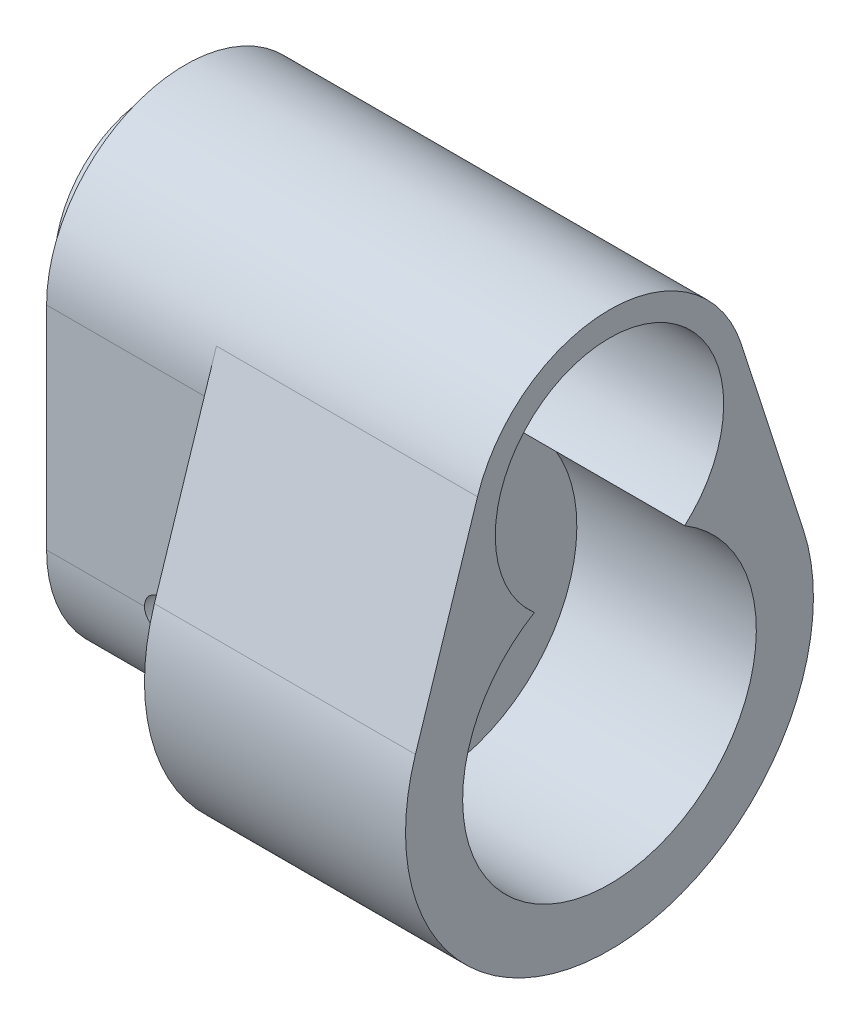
ISO-10303-21;
HEADER;
FILE_DESCRIPTION(('STEP AP214'),'2;1');
FILE_NAME('part.step','',(''),(''),'','','');
FILE_SCHEMA(('AUTOMOTIVE_DESIGN { 1 0 10303 214 1 1 1 1 }'));
ENDSEC;
DATA;
#1=APPLICATION_CONTEXT('core data for automotive mechanical design processes');
#2=APPLICATION_PROTOCOL_DEFINITION('international standard','automotive_design',2000,#1);
#3=PRODUCT_CONTEXT('',#1,'mechanical');
#4=PRODUCT('Part','Part','',(#3));
#5=PRODUCT_RELATED_PRODUCT_CATEGORY('part','',(#4));
#6=PRODUCT_DEFINITION_FORMATION('','',#4);
#7=PRODUCT_DEFINITION_CONTEXT('part definition',#1,'design');
#8=PRODUCT_DEFINITION('design','',#6,#7);
#9=PRODUCT_DEFINITION_SHAPE('','',#8);
#10=(LENGTH_UNIT() NAMED_UNIT(*) SI_UNIT(.MILLI.,.METRE.));
#11=(NAMED_UNIT(*) PLANE_ANGLE_UNIT() SI_UNIT($,.RADIAN.));
#12=(NAMED_UNIT(*) SI_UNIT($,.STERADIAN.) SOLID_ANGLE_UNIT());
#13=UNCERTAINTY_MEASURE_WITH_UNIT(LENGTH_MEASURE(1.E-05),#10,'distance_accuracy_value','');
#14=(GEOMETRIC_REPRESENTATION_CONTEXT(3) GLOBAL_UNCERTAINTY_ASSIGNED_CONTEXT((#13)) GLOBAL_UNIT_ASSIGNED_CONTEXT((#10,
#11,#12)) REPRESENTATION_CONTEXT('',''));
#15=CARTESIAN_POINT('',(0.,0.,0.));
#16=DIRECTION('',(0.,0.,1.));
#17=DIRECTION('',(1.,0.,0.));
#18=AXIS2_PLACEMENT_3D('',#15,#16,#17);
#19=CARTESIAN_POINT('',(-20.,26.,0.));
#20=DIRECTION('',(-1.,0.,0.));
#21=DIRECTION('',(0.,0.,1.));
#22=AXIS2_PLACEMENT_3D('',#19,#20,#21);
#23=PLANE('',#22);
#24=CARTESIAN_POINT('',(-20.,26.,0.));
#25=DIRECTION('',(-1.,0.,0.));
#26=DIRECTION('',(0.,0.,1.));
#27=AXIS2_PLACEMENT_3D('',#24,#25,#26);
#28=CIRCLE('',#27,17.);
#29=CARTESIAN_POINT('',(-20.,26.,17.));
#30=VERTEX_POINT('',#29);
#31=CARTESIAN_POINT('',(-20.,26.,-17.));
#32=VERTEX_POINT('',#31);
#33=EDGE_CURVE('E215',#30,#32,#28,.T.);
#34=ORIENTED_EDGE('',*,*,#33,.T.);
#35=DIRECTION('',(0.,-1.,0.));
#36=VECTOR('',#35,1.);
#37=CARTESIAN_POINT('',(-20.,26.,-17.));
#38=LINE('',#37,#36);
#39=CARTESIAN_POINT('',(-20.,0.,-17.));
#40=VERTEX_POINT('',#39);
#41=EDGE_CURVE('E218',#32,#40,#38,.T.);
#42=ORIENTED_EDGE('',*,*,#41,.T.);
#43=CARTESIAN_POINT('',(-20.,0.,0.));
#44=DIRECTION('',(-1.,0.,0.));
#45=DIRECTION('',(0.,0.,1.));
#46=AXIS2_PLACEMENT_3D('',#43,#44,#45);
#47=CIRCLE('',#46,17.);
#48=CARTESIAN_POINT('',(-20.,0.,17.));
#49=VERTEX_POINT('',#48);
#50=EDGE_CURVE('E225',#40,#49,#47,.T.);
#51=ORIENTED_EDGE('',*,*,#50,.T.);
#52=DIRECTION('',(0.,1.,0.));
#53=VECTOR('',#52,1.);
#54=CARTESIAN_POINT('',(-20.,26.,17.));
#55=LINE('',#54,#53);
#56=EDGE_CURVE('E139',#49,#30,#55,.T.);
#57=ORIENTED_EDGE('',*,*,#56,.T.);
#58=EDGE_LOOP('',(#34,#42,#51,#57));
#59=FACE_BOUND('',#58,.T.);
#60=CARTESIAN_POINT('',(-20.,0.,0.));
#61=DIRECTION('',(-1.,0.,0.));
#62=DIRECTION('',(0.,0.,1.));
#63=AXIS2_PLACEMENT_3D('',#60,#61,#62);
#64=CIRCLE('',#63,8.);
#65=CARTESIAN_POINT('',(-20.,0.,8.));
#66=VERTEX_POINT('',#65);
#67=EDGE_CURVE('E157',#66,#66,#64,.T.);
#68=ORIENTED_EDGE('',*,*,#67,.F.);
#69=EDGE_LOOP('',(#68));
#70=FACE_BOUND('',#69,.T.);
#71=CARTESIAN_POINT('',(-20.,26.,0.));
#72=DIRECTION('',(-1.,0.,0.));
#73=DIRECTION('',(0.,0.,1.));
#74=AXIS2_PLACEMENT_3D('',#71,#72,#73);
#75=CIRCLE('',#74,12.);
#76=CARTESIAN_POINT('',(-20.,26.,12.));
#77=VERTEX_POINT('',#76);
#78=EDGE_CURVE('E250',#77,#77,#75,.T.);
#79=ORIENTED_EDGE('',*,*,#78,.F.);
#80=EDGE_LOOP('',(#79));
#81=FACE_BOUND('',#80,.T.);
#82=ADVANCED_FACE('F31',(#59,#70,#81),#23,.T.);
#83=CARTESIAN_POINT('',(32.000025,26.,0.));
#84=DIRECTION('',(-1.,0.,0.));
#85=DIRECTION('',(0.,0.,1.));
#86=AXIS2_PLACEMENT_3D('',#83,#84,#85);
#87=CYLINDRICAL_SURFACE('',#86,10.);
#88=CARTESIAN_POINT('',(10.,26.,0.));
#89=DIRECTION('',(1.,0.,0.));
#90=DIRECTION('',(0.,0.,-1.));
#91=AXIS2_PLACEMENT_3D('',#88,#89,#90);
#92=CIRCLE('',#91,10.);
#93=CARTESIAN_POINT('',(10.,26.,-10.));
#94=VERTEX_POINT('',#93);
#95=EDGE_CURVE('E230',#94,#94,#92,.F.);
#96=ORIENTED_EDGE('',*,*,#95,.F.);
#97=EDGE_LOOP('',(#96));
#98=FACE_BOUND('',#97,.T.);
#99=CARTESIAN_POINT('',(-24.,26.,0.));
#100=DIRECTION('',(-1.,0.,0.));
#101=DIRECTION('',(0.,0.,1.));
#102=AXIS2_PLACEMENT_3D('',#99,#100,#101);
#103=CIRCLE('',#102,10.);
#104=CARTESIAN_POINT('',(-24.,26.,10.));
#105=VERTEX_POINT('',#104);
#106=EDGE_CURVE('E253',#105,#105,#103,.T.);
#107=ORIENTED_EDGE('',*,*,#106,.T.);
#108=EDGE_LOOP('',(#107));
#109=FACE_BOUND('',#108,.T.);
#110=ADVANCED_FACE('F317',(#98,#109),#87,.F.);
#111=CARTESIAN_POINT('',(32.000025,0.,0.));
#112=DIRECTION('',(-1.,0.,0.));
#113=DIRECTION('',(0.,0.,1.));
#114=AXIS2_PLACEMENT_3D('',#111,#112,#113);
#115=CYLINDRICAL_SURFACE('',#114,8.);
#116=CARTESIAN_POINT('',(-4.,0.,8.));
#117=CARTESIAN_POINT('',(-4.00000310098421,0.110501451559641,7.9999981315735));
#118=CARTESIAN_POINT('',(-4.00918873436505,0.221037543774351,7.99768770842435));
#119=CARTESIAN_POINT('',(-4.04563353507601,0.438941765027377,7.98869485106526));
#120=CARTESIAN_POINT('',(-4.07290294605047,0.546308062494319,7.98200993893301));
#121=CARTESIAN_POINT('',(-4.14458567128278,0.754694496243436,7.96500835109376));
#122=CARTESIAN_POINT('',(-4.18897839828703,0.855722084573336,7.95469603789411));
#123=CARTESIAN_POINT('',(-4.29357518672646,1.04889617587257,7.93153791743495));
#124=CARTESIAN_POINT('',(-4.35377978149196,1.14104237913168,7.91869202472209));
#125=CARTESIAN_POINT('',(-4.48960105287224,1.31573590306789,7.89156551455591));
#126=CARTESIAN_POINT('',(-4.56548209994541,1.39807425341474,7.87726276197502));
#127=CARTESIAN_POINT('',(-4.72993627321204,1.54899856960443,7.84898160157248));
#128=CARTESIAN_POINT('',(-4.81851083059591,1.61758298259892,7.83500323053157));
#129=CARTESIAN_POINT('',(-5.00746030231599,1.74003539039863,7.80873034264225));
#130=CARTESIAN_POINT('',(-5.10799097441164,1.79366962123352,7.79646392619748));
#131=CARTESIAN_POINT('',(-5.31699788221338,1.88319587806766,7.77532659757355));
#132=CARTESIAN_POINT('',(-5.42547284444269,1.91909074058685,7.76645514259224));
#133=CARTESIAN_POINT('',(-5.64499133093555,1.97140644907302,7.7533396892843));
#134=CARTESIAN_POINT('',(-5.75593986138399,1.98820302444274,7.74900654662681));
#135=CARTESIAN_POINT('',(-5.97915809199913,2.00301570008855,7.74519149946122));
#136=CARTESIAN_POINT('',(-6.09142757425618,2.00103485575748,7.74570880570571));
#137=CARTESIAN_POINT('',(-6.3112210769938,1.97864869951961,7.75145607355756));
#138=CARTESIAN_POINT('',(-6.41879416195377,1.95869112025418,7.75657150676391));
#139=CARTESIAN_POINT('',(-6.62901473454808,1.90163224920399,7.77075612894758));
#140=CARTESIAN_POINT('',(-6.73166187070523,1.86452973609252,7.77982559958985));
#141=CARTESIAN_POINT('',(-6.93031735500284,1.77385263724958,7.80100151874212));
#142=CARTESIAN_POINT('',(-7.02624822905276,1.72011555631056,7.81313769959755));
#143=CARTESIAN_POINT('',(-7.20789161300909,1.59780836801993,7.83906281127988));
#144=CARTESIAN_POINT('',(-7.29360233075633,1.52923566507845,7.85285203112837));
#145=CARTESIAN_POINT('',(-7.45493815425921,1.37688456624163,7.88101174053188));
#146=CARTESIAN_POINT('',(-7.53020598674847,1.29272834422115,7.89538759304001));
#147=CARTESIAN_POINT('',(-7.6656283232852,1.11281589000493,7.92274620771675));
#148=CARTESIAN_POINT('',(-7.72578236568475,1.01705930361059,7.93572892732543));
#149=CARTESIAN_POINT('',(-7.82940078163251,0.816154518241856,7.9589030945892));
#150=CARTESIAN_POINT('',(-7.87280712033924,0.710975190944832,7.96908480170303));
#151=CARTESIAN_POINT('',(-7.94122307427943,0.494501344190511,7.98543889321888));
#152=CARTESIAN_POINT('',(-7.96623620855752,0.383207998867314,7.99161204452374));
#153=CARTESIAN_POINT('',(-7.99661008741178,0.160719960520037,7.999139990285));
#154=CARTESIAN_POINT('',(-8.0024573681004,0.0495956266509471,8.00061404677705));
#155=CARTESIAN_POINT('',(-7.99566799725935,-0.172043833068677,7.99891739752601));
#156=CARTESIAN_POINT('',(-7.98303300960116,-0.282559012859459,7.99574710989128));
#157=CARTESIAN_POINT('',(-7.94003878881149,-0.498152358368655,7.98519441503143));
#158=CARTESIAN_POINT('',(-7.90994498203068,-0.603286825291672,7.97787512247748));
#159=CARTESIAN_POINT('',(-7.83319055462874,-0.807009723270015,7.95984942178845));
#160=CARTESIAN_POINT('',(-7.78652826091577,-0.905597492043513,7.94914267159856));
#161=CARTESIAN_POINT('',(-7.6770184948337,-1.0953641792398,7.92524410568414));
#162=CARTESIAN_POINT('',(-7.61389851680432,-1.18638058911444,7.91201156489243));
#163=CARTESIAN_POINT('',(-7.47361345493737,-1.35670215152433,7.88459345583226));
#164=CARTESIAN_POINT('',(-7.39644594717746,-1.43600527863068,7.87040772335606));
#165=CARTESIAN_POINT('',(-7.22799738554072,-1.58265409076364,7.84225275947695));
#166=CARTESIAN_POINT('',(-7.13641639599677,-1.64965849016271,7.82829738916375));
#167=CARTESIAN_POINT('',(-6.94302315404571,-1.7673476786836,7.80257171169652));
#168=CARTESIAN_POINT('',(-6.84121135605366,-1.81803319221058,7.79080130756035));
#169=CARTESIAN_POINT('',(-6.6307923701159,-1.90126856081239,7.77090792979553));
#170=CARTESIAN_POINT('',(-6.52222982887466,-1.93392586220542,7.76276340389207));
#171=CARTESIAN_POINT('',(-6.30092048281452,-1.98046087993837,7.75102325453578));
#172=CARTESIAN_POINT('',(-6.18817459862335,-1.99434270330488,7.74742663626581));
#173=CARTESIAN_POINT('',(-5.96517196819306,-2.00271812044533,7.74526534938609));
#174=CARTESIAN_POINT('',(-5.85493675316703,-1.99775719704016,7.74655910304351));
#175=CARTESIAN_POINT('',(-5.63692814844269,-1.96983637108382,7.7537054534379));
#176=CARTESIAN_POINT('',(-5.52915470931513,-1.94687683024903,7.75955795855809));
#177=CARTESIAN_POINT('',(-5.31972205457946,-1.88390842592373,7.77508347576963));
#178=CARTESIAN_POINT('',(-5.21803025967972,-1.84400187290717,7.78473353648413));
#179=CARTESIAN_POINT('',(-5.02271282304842,-1.74835321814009,7.80677007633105));
#180=CARTESIAN_POINT('',(-4.92908830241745,-1.69260892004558,7.81915693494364));
#181=CARTESIAN_POINT('',(-4.74992716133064,-1.56515699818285,7.84567512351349));
#182=CARTESIAN_POINT('',(-4.66466523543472,-1.49307088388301,7.85984353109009));
#183=CARTESIAN_POINT('',(-4.50727060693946,-1.33571916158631,7.88810702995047));
#184=CARTESIAN_POINT('',(-4.43514102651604,-1.25045042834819,7.90220210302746));
#185=CARTESIAN_POINT('',(-4.30478492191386,-1.06729011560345,7.92903540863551));
#186=CARTESIAN_POINT('',(-4.24683384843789,-0.969197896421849,7.94174444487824));
#187=CARTESIAN_POINT('',(-4.14833671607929,-0.764354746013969,7.96406566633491));
#188=CARTESIAN_POINT('',(-4.10777818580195,-0.65761008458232,7.97368006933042));
#189=CARTESIAN_POINT('',(-4.05123755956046,-0.459213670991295,7.98730746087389));
#190=CARTESIAN_POINT('',(-4.03206500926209,-0.368506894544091,7.9920344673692));
#191=CARTESIAN_POINT('',(-4.00644540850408,-0.18520809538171,7.99838140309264));
#192=CARTESIAN_POINT('',(-3.99999740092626,-0.0926162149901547,8.00000156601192));
#193=CARTESIAN_POINT('',(-4.,0.,8.));
#194=B_SPLINE_CURVE_WITH_KNOTS('',3,(#116,#117,#118,#119,#120,#121,#122,#123,#124,#125,#126,
#127,#128,#129,#130,#131,#132,#133,#134,#135,#136,#137,#138,#139,#140,#141,#142,#143,#144,#145,
#146,#147,#148,#149,#150,#151,#152,#153,#154,#155,#156,#157,#158,#159,#160,#161,#162,#163,#164,
#165,#166,#167,#168,#169,#170,#171,#172,#173,#174,#175,#176,#177,#178,#179,#180,#181,#182,#183,
#184,#185,#186,#187,#188,#189,#190,#191,#192,#193),.UNSPECIFIED.,.T.,.F.,(4,2,2,2,2,2,2,2,2,2,2,
2,2,2,2,2,2,2,2,2,2,2,2,2,2,2,2,2,2,2,2,2,2,2,2,2,2,2,4),(0.,0.33116494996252,0.662517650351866,
0.993473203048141,1.32443992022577,1.66152580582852,1.99864972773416,2.34078196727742,
2.68285948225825,3.01808393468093,3.3532538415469,3.68029996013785,4.00736937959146,
4.337740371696,4.66816921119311,5.00802001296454,5.34788119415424,5.6889097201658,
6.02987298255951,6.36211078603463,6.69431868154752,7.02160366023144,7.34892169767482,
7.68204783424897,8.01523150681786,8.35659345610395,8.69794025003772,9.03723006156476,
9.37644564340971,9.70591707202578,10.0353818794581,10.3628853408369,10.6904342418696,
11.0265276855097,11.3627009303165,11.7049624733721,12.0469781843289,12.3245632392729,
12.6021274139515),.UNSPECIFIED.);
#195=CARTESIAN_POINT('',(-4.,0.,8.));
#196=VERTEX_POINT('',#195);
#197=EDGE_CURVE('E258',#196,#196,#194,.T.);
#198=ORIENTED_EDGE('',*,*,#197,.T.);
#199=EDGE_LOOP('',(#198));
#200=FACE_BOUND('',#199,.T.);
#201=CARTESIAN_POINT('',(-4.,0.,-8.));
#202=CARTESIAN_POINT('',(-4.00000310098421,-0.110501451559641,-7.9999981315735));
#203=CARTESIAN_POINT('',(-4.00918873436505,-0.221037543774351,-7.99768770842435));
#204=CARTESIAN_POINT('',(-4.04563353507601,-0.438941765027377,-7.98869485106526));
#205=CARTESIAN_POINT('',(-4.07290294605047,-0.546308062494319,-7.98200993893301));
#206=CARTESIAN_POINT('',(-4.14458567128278,-0.754694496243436,-7.96500835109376));
#207=CARTESIAN_POINT('',(-4.18897839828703,-0.855722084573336,-7.95469603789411));
#208=CARTESIAN_POINT('',(-4.29357518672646,-1.04889617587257,-7.93153791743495));
#209=CARTESIAN_POINT('',(-4.35377978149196,-1.14104237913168,-7.91869202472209));
#210=CARTESIAN_POINT('',(-4.48960105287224,-1.31573590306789,-7.89156551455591));
#211=CARTESIAN_POINT('',(-4.56548209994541,-1.39807425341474,-7.87726276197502));
#212=CARTESIAN_POINT('',(-4.72993627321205,-1.54899856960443,-7.84898160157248));
#213=CARTESIAN_POINT('',(-4.81851083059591,-1.61758298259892,-7.83500323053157));
#214=CARTESIAN_POINT('',(-5.00746030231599,-1.74003539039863,-7.80873034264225));
#215=CARTESIAN_POINT('',(-5.10799097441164,-1.79366962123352,-7.79646392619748));
#216=CARTESIAN_POINT('',(-5.31699788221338,-1.88319587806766,-7.77532659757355));
#217=CARTESIAN_POINT('',(-5.42547284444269,-1.91909074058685,-7.76645514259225));
#218=CARTESIAN_POINT('',(-5.64499133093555,-1.97140644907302,-7.7533396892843));
#219=CARTESIAN_POINT('',(-5.75593986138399,-1.98820302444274,-7.74900654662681));
#220=CARTESIAN_POINT('',(-5.97915809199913,-2.00301570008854,-7.74519149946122));
#221=CARTESIAN_POINT('',(-6.09142757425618,-2.00103485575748,-7.74570880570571));
#222=CARTESIAN_POINT('',(-6.3112210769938,-1.97864869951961,-7.75145607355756));
#223=CARTESIAN_POINT('',(-6.41879416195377,-1.95869112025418,-7.75657150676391));
#224=CARTESIAN_POINT('',(-6.62901473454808,-1.90163224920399,-7.77075612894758));
#225=CARTESIAN_POINT('',(-6.73166187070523,-1.86452973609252,-7.77982559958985));
#226=CARTESIAN_POINT('',(-6.93031735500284,-1.77385263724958,-7.80100151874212));
#227=CARTESIAN_POINT('',(-7.02624822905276,-1.72011555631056,-7.81313769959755));
#228=CARTESIAN_POINT('',(-7.20789161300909,-1.59780836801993,-7.83906281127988));
#229=CARTESIAN_POINT('',(-7.29360233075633,-1.52923566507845,-7.85285203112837));
#230=CARTESIAN_POINT('',(-7.45493815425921,-1.37688456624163,-7.88101174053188));
#231=CARTESIAN_POINT('',(-7.53020598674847,-1.29272834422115,-7.89538759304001));
#232=CARTESIAN_POINT('',(-7.6656283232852,-1.11281589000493,-7.92274620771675));
#233=CARTESIAN_POINT('',(-7.72578236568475,-1.01705930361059,-7.93572892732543));
#234=CARTESIAN_POINT('',(-7.82940078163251,-0.816154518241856,-7.9589030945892));
#235=CARTESIAN_POINT('',(-7.87280712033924,-0.710975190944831,-7.96908480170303));
#236=CARTESIAN_POINT('',(-7.94122307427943,-0.49450134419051,-7.98543889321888));
#237=CARTESIAN_POINT('',(-7.96623620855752,-0.383207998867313,-7.99161204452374));
#238=CARTESIAN_POINT('',(-7.99661008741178,-0.160719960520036,-7.999139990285));
#239=CARTESIAN_POINT('',(-8.0024573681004,-0.0495956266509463,-8.00061404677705));
#240=CARTESIAN_POINT('',(-7.99566799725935,0.172043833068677,-7.99891739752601));
#241=CARTESIAN_POINT('',(-7.98303300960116,0.28255901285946,-7.99574710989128));
#242=CARTESIAN_POINT('',(-7.94003878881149,0.498152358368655,-7.98519441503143));
#243=CARTESIAN_POINT('',(-7.90994498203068,0.603286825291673,-7.97787512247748));
#244=CARTESIAN_POINT('',(-7.83319055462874,0.807009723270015,-7.95984942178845));
#245=CARTESIAN_POINT('',(-7.78652826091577,0.905597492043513,-7.94914267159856));
#246=CARTESIAN_POINT('',(-7.6770184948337,1.0953641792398,-7.92524410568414));
#247=CARTESIAN_POINT('',(-7.61389851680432,1.18638058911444,-7.91201156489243));
#248=CARTESIAN_POINT('',(-7.47361345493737,1.35670215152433,-7.88459345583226));
#249=CARTESIAN_POINT('',(-7.39644594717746,1.43600527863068,-7.87040772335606));
#250=CARTESIAN_POINT('',(-7.22799738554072,1.58265409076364,-7.84225275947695));
#251=CARTESIAN_POINT('',(-7.13641639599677,1.64965849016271,-7.82829738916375));
#252=CARTESIAN_POINT('',(-6.94302315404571,1.7673476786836,-7.80257171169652));
#253=CARTESIAN_POINT('',(-6.84121135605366,1.81803319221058,-7.79080130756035));
#254=CARTESIAN_POINT('',(-6.6307923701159,1.90126856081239,-7.77090792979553));
#255=CARTESIAN_POINT('',(-6.52222982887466,1.93392586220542,-7.76276340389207));
#256=CARTESIAN_POINT('',(-6.30092048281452,1.98046087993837,-7.75102325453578));
#257=CARTESIAN_POINT('',(-6.18817459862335,1.99434270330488,-7.74742663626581));
#258=CARTESIAN_POINT('',(-5.96517196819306,2.00271812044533,-7.74526534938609));
#259=CARTESIAN_POINT('',(-5.85493675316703,1.99775719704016,-7.74655910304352));
#260=CARTESIAN_POINT('',(-5.63692814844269,1.96983637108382,-7.7537054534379));
#261=CARTESIAN_POINT('',(-5.52915470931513,1.94687683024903,-7.75955795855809));
#262=CARTESIAN_POINT('',(-5.31972205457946,1.88390842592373,-7.77508347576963));
#263=CARTESIAN_POINT('',(-5.21803025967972,1.84400187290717,-7.78473353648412));
#264=CARTESIAN_POINT('',(-5.02271282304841,1.74835321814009,-7.80677007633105));
#265=CARTESIAN_POINT('',(-4.92908830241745,1.69260892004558,-7.81915693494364));
#266=CARTESIAN_POINT('',(-4.74992716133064,1.56515699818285,-7.84567512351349));
#267=CARTESIAN_POINT('',(-4.66466523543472,1.49307088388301,-7.85984353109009));
#268=CARTESIAN_POINT('',(-4.50727060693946,1.33571916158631,-7.88810702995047));
#269=CARTESIAN_POINT('',(-4.43514102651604,1.25045042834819,-7.90220210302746));
#270=CARTESIAN_POINT('',(-4.30478492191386,1.06729011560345,-7.92903540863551));
#271=CARTESIAN_POINT('',(-4.24683384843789,0.969197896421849,-7.94174444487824));
#272=CARTESIAN_POINT('',(-4.14833671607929,0.764354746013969,-7.96406566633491));
#273=CARTESIAN_POINT('',(-4.10777818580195,0.65761008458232,-7.97368006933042));
#274=CARTESIAN_POINT('',(-4.05123755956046,0.459213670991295,-7.98730746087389));
#275=CARTESIAN_POINT('',(-4.03206500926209,0.368506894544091,-7.9920344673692));
#276=CARTESIAN_POINT('',(-4.00644540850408,0.18520809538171,-7.99838140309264));
#277=CARTESIAN_POINT('',(-3.99999740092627,0.0926162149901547,-8.00000156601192));
#278=CARTESIAN_POINT('',(-4.,0.,-8.));
#279=B_SPLINE_CURVE_WITH_KNOTS('',3,(#201,#202,#203,#204,#205,#206,#207,#208,#209,#210,#211,
#212,#213,#214,#215,#216,#217,#218,#219,#220,#221,#222,#223,#224,#225,#226,#227,#228,#229,#230,
#231,#232,#233,#234,#235,#236,#237,#238,#239,#240,#241,#242,#243,#244,#245,#246,#247,#248,#249,
#250,#251,#252,#253,#254,#255,#256,#257,#258,#259,#260,#261,#262,#263,#264,#265,#266,#267,#268,
#269,#270,#271,#272,#273,#274,#275,#276,#277,#278),.UNSPECIFIED.,.T.,.F.,(4,2,2,2,2,2,2,2,2,2,2,
2,2,2,2,2,2,2,2,2,2,2,2,2,2,2,2,2,2,2,2,2,2,2,2,2,2,2,4),(0.,0.33116494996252,0.662517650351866,
0.993473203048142,1.32443992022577,1.66152580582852,1.99864972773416,2.34078196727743,
2.68285948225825,3.01808393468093,3.3532538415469,3.68029996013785,4.00736937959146,
4.337740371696,4.66816921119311,5.00802001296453,5.34788119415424,5.6889097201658,
6.02987298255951,6.36211078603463,6.69431868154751,7.02160366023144,7.34892169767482,
7.68204783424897,8.01523150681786,8.35659345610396,8.69794025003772,9.03723006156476,
9.37644564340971,9.70591707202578,10.0353818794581,10.3628853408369,10.6904342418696,
11.0265276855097,11.3627009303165,11.7049624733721,12.0469781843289,12.3245632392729,
12.6021274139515),.UNSPECIFIED.);
#280=CARTESIAN_POINT('',(-4.,0.,-8.));
#281=VERTEX_POINT('',#280);
#282=EDGE_CURVE('E265',#281,#281,#279,.T.);
#283=ORIENTED_EDGE('',*,*,#282,.T.);
#284=EDGE_LOOP('',(#283));
#285=FACE_BOUND('',#284,.T.);
#286=ORIENTED_EDGE('',*,*,#67,.T.);
#287=EDGE_LOOP('',(#286));
#288=FACE_BOUND('',#287,.T.);
#289=CARTESIAN_POINT('',(10.,0.,0.));
#290=DIRECTION('',(1.,0.,0.));
#291=DIRECTION('',(0.,0.,-1.));
#292=AXIS2_PLACEMENT_3D('',#289,#290,#291);
#293=CIRCLE('',#292,8.);
#294=CARTESIAN_POINT('',(10.,0.,-8.));
#295=VERTEX_POINT('',#294);
#296=EDGE_CURVE('E35',#295,#295,#293,.F.);
#297=ORIENTED_EDGE('',*,*,#296,.F.);
#298=EDGE_LOOP('',(#297));
#299=FACE_BOUND('',#298,.T.);
#300=ADVANCED_FACE('F269',(#200,#285,#288,#299),#115,.F.);
#301=CARTESIAN_POINT('',(0.,26.,0.));
#302=DIRECTION('',(1.,0.,0.));
#303=DIRECTION('',(0.,0.,-1.));
#304=AXIS2_PLACEMENT_3D('',#301,#302,#303);
#305=PLANE('',#304);
#306=CARTESIAN_POINT('',(0.,26.,0.));
#307=DIRECTION('',(-1.,0.,0.));
#308=DIRECTION('',(0.,0.,1.));
#309=AXIS2_PLACEMENT_3D('',#306,#307,#308);
#310=CIRCLE('',#309,17.);
#311=CARTESIAN_POINT('',(0.,26.,17.));
#312=VERTEX_POINT('',#311);
#313=CARTESIAN_POINT('',(0.,31.2307692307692,16.1752605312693));
#314=VERTEX_POINT('',#313);
#315=EDGE_CURVE('E152',#312,#314,#310,.T.);
#316=ORIENTED_EDGE('',*,*,#315,.F.);
#317=DIRECTION('',(0.,1.,0.));
#318=VECTOR('',#317,1.);
#319=CARTESIAN_POINT('',(0.,26.,17.));
#320=LINE('',#319,#318);
#321=CARTESIAN_POINT('',(0.,0.,17.));
#322=VERTEX_POINT('',#321);
#323=EDGE_CURVE('E214',#322,#312,#320,.T.);
#324=ORIENTED_EDGE('',*,*,#323,.F.);
#325=CARTESIAN_POINT('',(0.,0.,0.));
#326=DIRECTION('',(-1.,0.,0.));
#327=DIRECTION('',(0.,0.,1.));
#328=AXIS2_PLACEMENT_3D('',#325,#326,#327);
#329=CIRCLE('',#328,17.);
#330=CARTESIAN_POINT('',(0.,0.,-17.));
#331=VERTEX_POINT('',#330);
#332=EDGE_CURVE('E216',#331,#322,#329,.T.);
#333=ORIENTED_EDGE('',*,*,#332,.F.);
#334=DIRECTION('',(0.,-1.,0.));
#335=VECTOR('',#334,1.);
#336=CARTESIAN_POINT('',(0.,26.,-17.));
#337=LINE('',#336,#335);
#338=CARTESIAN_POINT('',(0.,26.,-17.));
#339=VERTEX_POINT('',#338);
#340=EDGE_CURVE('E156',#339,#331,#337,.T.);
#341=ORIENTED_EDGE('',*,*,#340,.F.);
#342=CARTESIAN_POINT('',(0.,31.2307692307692,-16.1752605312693));
#343=VERTEX_POINT('',#342);
#344=EDGE_CURVE('E11',#343,#339,#310,.T.);
#345=ORIENTED_EDGE('',*,*,#344,.F.);
#346=DIRECTION('',(0.,0.951485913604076,0.307692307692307));
#347=VECTOR('',#346,1.);
#348=CARTESIAN_POINT('',(0.,31.2307692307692,-16.1752605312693));
#349=LINE('',#348,#347);
#350=CARTESIAN_POINT('',(0.,7.69230769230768,-23.7871478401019));
#351=VERTEX_POINT('',#350);
#352=EDGE_CURVE('E166',#351,#343,#349,.T.);
#353=ORIENTED_EDGE('',*,*,#352,.F.);
#354=CARTESIAN_POINT('',(0.,0.,0.));
#355=DIRECTION('',(1.,0.,0.));
#356=DIRECTION('',(0.,0.,-1.));
#357=AXIS2_PLACEMENT_3D('',#354,#355,#356);
#358=CIRCLE('',#357,25.);
#359=CARTESIAN_POINT('',(0.,7.69230769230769,23.7871478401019));
#360=VERTEX_POINT('',#359);
#361=EDGE_CURVE('E169',#360,#351,#358,.T.);
#362=ORIENTED_EDGE('',*,*,#361,.F.);
#363=DIRECTION('',(0.,-0.951485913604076,0.307692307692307));
#364=VECTOR('',#363,1.);
#365=CARTESIAN_POINT('',(0.,31.2307692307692,16.1752605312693));
#366=LINE('',#365,#364);
#367=EDGE_CURVE('E151',#314,#360,#366,.T.);
#368=ORIENTED_EDGE('',*,*,#367,.F.);
#369=EDGE_LOOP('',(#316,#324,#333,#341,#345,#353,#362,#368));
#370=FACE_BOUND('',#369,.T.);
#371=ADVANCED_FACE('F212',(#370),#305,.F.);
#372=CARTESIAN_POINT('',(32.,26.,0.));
#373=DIRECTION('',(-1.,0.,0.));
#374=DIRECTION('',(0.,0.,1.));
#375=AXIS2_PLACEMENT_3D('',#372,#373,#374);
#376=CYLINDRICAL_SURFACE('',#375,17.);
#377=DIRECTION('',(-1.,0.,0.));
#378=VECTOR('',#377,1.);
#379=CARTESIAN_POINT('',(32.,31.2307692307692,-16.1752605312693));
#380=LINE('',#379,#378);
#381=CARTESIAN_POINT('',(32.,31.2307692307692,-16.1752605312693));
#382=VERTEX_POINT('',#381);
#383=EDGE_CURVE('E172',#382,#343,#380,.T.);
#384=ORIENTED_EDGE('',*,*,#383,.T.);
#385=ORIENTED_EDGE('',*,*,#344,.T.);
#386=DIRECTION('',(1.,0.,0.));
#387=VECTOR('',#386,1.);
#388=CARTESIAN_POINT('',(-20.,26.,-17.));
#389=LINE('',#388,#387);
#390=EDGE_CURVE('E148',#32,#339,#389,.T.);
#391=ORIENTED_EDGE('',*,*,#390,.F.);
#392=ORIENTED_EDGE('',*,*,#33,.F.);
#393=DIRECTION('',(1.,0.,0.));
#394=VECTOR('',#393,1.);
#395=CARTESIAN_POINT('',(-20.,26.,17.));
#396=LINE('',#395,#394);
#397=EDGE_CURVE('E144',#30,#312,#396,.T.);
#398=ORIENTED_EDGE('',*,*,#397,.T.);
#399=ORIENTED_EDGE('',*,*,#315,.T.);
#400=DIRECTION('',(-1.,0.,0.));
#401=VECTOR('',#400,1.);
#402=CARTESIAN_POINT('',(32.,31.2307692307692,16.1752605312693));
#403=LINE('',#402,#401);
#404=CARTESIAN_POINT('',(32.,31.2307692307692,16.1752605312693));
#405=VERTEX_POINT('',#404);
#406=EDGE_CURVE('E40',#405,#314,#403,.T.);
#407=ORIENTED_EDGE('',*,*,#406,.F.);
#408=CARTESIAN_POINT('',(32.,26.,0.));
#409=DIRECTION('',(1.,0.,0.));
#410=DIRECTION('',(0.,0.,-1.));
#411=AXIS2_PLACEMENT_3D('',#408,#409,#410);
#412=CIRCLE('',#411,17.);
#413=EDGE_CURVE('E158',#382,#405,#412,.T.);
#414=ORIENTED_EDGE('',*,*,#413,.F.);
#415=EDGE_LOOP('',(#384,#385,#391,#392,#398,#399,#407,#414));
#416=FACE_BOUND('',#415,.T.);
#417=ADVANCED_FACE('F33',(#416),#376,.T.);
#418=CARTESIAN_POINT('',(32.,31.2307692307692,16.1752605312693));
#419=DIRECTION('',(0.,-0.307692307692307,-0.951485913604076));
#420=DIRECTION('',(0.,0.951485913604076,-0.307692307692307));
#421=AXIS2_PLACEMENT_3D('',#418,#419,#420);
#422=PLANE('',#421);
#423=ORIENTED_EDGE('',*,*,#367,.T.);
#424=DIRECTION('',(-1.,0.,0.));
#425=VECTOR('',#424,1.);
#426=CARTESIAN_POINT('',(32.,7.69230769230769,23.7871478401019));
#427=LINE('',#426,#425);
#428=CARTESIAN_POINT('',(32.,7.69230769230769,23.7871478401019));
#429=VERTEX_POINT('',#428);
#430=EDGE_CURVE('E162',#429,#360,#427,.T.);
#431=ORIENTED_EDGE('',*,*,#430,.F.);
#432=DIRECTION('',(0.,-0.951485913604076,0.307692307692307));
#433=VECTOR('',#432,1.);
#434=CARTESIAN_POINT('',(32.,31.2307692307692,16.1752605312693));
#435=LINE('',#434,#433);
#436=EDGE_CURVE('E200',#405,#429,#435,.T.);
#437=ORIENTED_EDGE('',*,*,#436,.F.);
#438=ORIENTED_EDGE('',*,*,#406,.T.);
#439=EDGE_LOOP('',(#423,#431,#437,#438));
#440=FACE_BOUND('',#439,.T.);
#441=ADVANCED_FACE('F311',(#440),#422,.F.);
#442=CARTESIAN_POINT('',(32.,0.,0.));
#443=DIRECTION('',(-1.,0.,0.));
#444=DIRECTION('',(0.,0.,1.));
#445=AXIS2_PLACEMENT_3D('',#442,#443,#444);
#446=CYLINDRICAL_SURFACE('',#445,25.);
#447=ORIENTED_EDGE('',*,*,#361,.T.);
#448=DIRECTION('',(-1.,0.,0.));
#449=VECTOR('',#448,1.);
#450=CARTESIAN_POINT('',(32.,7.69230769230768,-23.7871478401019));
#451=LINE('',#450,#449);
#452=CARTESIAN_POINT('',(32.,7.69230769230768,-23.7871478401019));
#453=VERTEX_POINT('',#452);
#454=EDGE_CURVE('E175',#453,#351,#451,.T.);
#455=ORIENTED_EDGE('',*,*,#454,.F.);
#456=CARTESIAN_POINT('',(32.,0.,0.));
#457=DIRECTION('',(1.,0.,0.));
#458=DIRECTION('',(0.,0.,-1.));
#459=AXIS2_PLACEMENT_3D('',#456,#457,#458);
#460=CIRCLE('',#459,25.);
#461=EDGE_CURVE('E199',#429,#453,#460,.T.);
#462=ORIENTED_EDGE('',*,*,#461,.F.);
#463=ORIENTED_EDGE('',*,*,#430,.T.);
#464=EDGE_LOOP('',(#447,#455,#462,#463));
#465=FACE_BOUND('',#464,.T.);
#466=ADVANCED_FACE('F309',(#465),#446,.T.);
#467=CARTESIAN_POINT('',(32.,31.2307692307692,-16.1752605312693));
#468=DIRECTION('',(0.,-0.307692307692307,0.951485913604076));
#469=DIRECTION('',(0.,-0.951485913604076,-0.307692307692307));
#470=AXIS2_PLACEMENT_3D('',#467,#468,#469);
#471=PLANE('',#470);
#472=ORIENTED_EDGE('',*,*,#352,.T.);
#473=ORIENTED_EDGE('',*,*,#383,.F.);
#474=DIRECTION('',(0.,0.951485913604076,0.307692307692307));
#475=VECTOR('',#474,1.);
#476=CARTESIAN_POINT('',(32.,31.2307692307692,-16.1752605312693));
#477=LINE('',#476,#475);
#478=EDGE_CURVE('E176',#453,#382,#477,.T.);
#479=ORIENTED_EDGE('',*,*,#478,.F.);
#480=ORIENTED_EDGE('',*,*,#454,.T.);
#481=EDGE_LOOP('',(#472,#473,#479,#480));
#482=FACE_BOUND('',#481,.T.);
#483=ADVANCED_FACE('F303',(#482),#471,.F.);
#484=CARTESIAN_POINT('',(32.,26.,0.));
#485=DIRECTION('',(1.,0.,0.));
#486=DIRECTION('',(0.,0.,-1.));
#487=AXIS2_PLACEMENT_3D('',#484,#485,#486);
#488=PLANE('',#487);
#489=CARTESIAN_POINT('',(32.,0.,0.));
#490=DIRECTION('',(1.,0.,0.));
#491=DIRECTION('',(0.,0.,-1.));
#492=AXIS2_PLACEMENT_3D('',#489,#490,#491);
#493=CIRCLE('',#492,18.);
#494=CARTESIAN_POINT('',(32.,15.4615384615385,9.21633486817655));
#495=VERTEX_POINT('',#494);
#496=CARTESIAN_POINT('',(32.,15.4615384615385,-9.21633486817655));
#497=VERTEX_POINT('',#496);
#498=EDGE_CURVE('E243',#495,#497,#493,.T.);
#499=ORIENTED_EDGE('',*,*,#498,.F.);
#500=CARTESIAN_POINT('',(32.,26.,0.));
#501=DIRECTION('',(1.,0.,0.));
#502=DIRECTION('',(0.,0.,-1.));
#503=AXIS2_PLACEMENT_3D('',#500,#501,#502);
#504=CIRCLE('',#503,14.);
#505=EDGE_CURVE('E239',#497,#495,#504,.T.);
#506=ORIENTED_EDGE('',*,*,#505,.F.);
#507=EDGE_LOOP('',(#499,#506));
#508=FACE_BOUND('',#507,.T.);
#509=ORIENTED_EDGE('',*,*,#413,.T.);
#510=ORIENTED_EDGE('',*,*,#436,.T.);
#511=ORIENTED_EDGE('',*,*,#461,.T.);
#512=ORIENTED_EDGE('',*,*,#478,.T.);
#513=EDGE_LOOP('',(#509,#510,#511,#512));
#514=FACE_BOUND('',#513,.T.);
#515=ADVANCED_FACE('F204',(#508,#514),#488,.T.);
#516=CARTESIAN_POINT('',(-20.,26.,-17.));
#517=DIRECTION('',(0.,0.,1.));
#518=DIRECTION('',(0.,-1.,0.));
#519=AXIS2_PLACEMENT_3D('',#516,#517,#518);
#520=PLANE('',#519);
#521=DIRECTION('',(1.,0.,0.));
#522=VECTOR('',#521,1.);
#523=CARTESIAN_POINT('',(-20.,0.,-17.));
#524=LINE('',#523,#522);
#525=CARTESIAN_POINT('',(-4.,0.,-17.));
#526=VERTEX_POINT('',#525);
#527=EDGE_CURVE('E140',#526,#331,#524,.T.);
#528=ORIENTED_EDGE('',*,*,#527,.F.);
#529=CARTESIAN_POINT('',(-6.,0.,-17.));
#530=DIRECTION('',(0.,0.,1.));
#531=DIRECTION('',(0.,-1.,0.));
#532=AXIS2_PLACEMENT_3D('',#529,#530,#531);
#533=CIRCLE('',#532,2.);
#534=CARTESIAN_POINT('',(-8.,0.,-17.));
#535=VERTEX_POINT('',#534);
#536=EDGE_CURVE('E47',#526,#535,#533,.T.);
#537=ORIENTED_EDGE('',*,*,#536,.T.);
#538=EDGE_CURVE('E142',#40,#535,#524,.T.);
#539=ORIENTED_EDGE('',*,*,#538,.F.);
#540=ORIENTED_EDGE('',*,*,#41,.F.);
#541=ORIENTED_EDGE('',*,*,#390,.T.);
#542=ORIENTED_EDGE('',*,*,#340,.T.);
#543=EDGE_LOOP('',(#528,#537,#539,#540,#541,#542));
#544=FACE_BOUND('',#543,.T.);
#545=ADVANCED_FACE('F295',(#544),#520,.F.);
#546=CARTESIAN_POINT('',(-20.,0.,0.));
#547=DIRECTION('',(1.,0.,0.));
#548=DIRECTION('',(0.,0.,-1.));
#549=AXIS2_PLACEMENT_3D('',#546,#547,#548);
#550=CYLINDRICAL_SURFACE('',#549,17.);
#551=ORIENTED_EDGE('',*,*,#538,.T.);
#552=CARTESIAN_POINT('',(-8.,0.,-17.));
#553=CARTESIAN_POINT('',(-7.99999985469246,-0.0560622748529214,-17.0000015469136));
#554=CARTESIAN_POINT('',(-7.99764128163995,-0.112097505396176,-16.9997223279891));
#555=CARTESIAN_POINT('',(-7.98823347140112,-0.223763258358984,-16.9986187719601));
#556=CARTESIAN_POINT('',(-7.98118457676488,-0.279393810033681,-16.9977944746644));
#557=CARTESIAN_POINT('',(-7.95307634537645,-0.44495772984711,-16.9945326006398));
#558=CARTESIAN_POINT('',(-7.92505523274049,-0.553776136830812,-16.9913059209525));
#559=CARTESIAN_POINT('',(-7.85125414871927,-0.765120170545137,-16.9831037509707));
#560=CARTESIAN_POINT('',(-7.80546803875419,-0.867643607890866,-16.9781276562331));
#561=CARTESIAN_POINT('',(-7.69745381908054,-1.06355769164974,-16.9669818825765));
#562=CARTESIAN_POINT('',(-7.635227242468,-1.15694918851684,-16.9608123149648));
#563=CARTESIAN_POINT('',(-7.49578173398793,-1.33238466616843,-16.9479360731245));
#564=CARTESIAN_POINT('',(-7.4184998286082,-1.41437841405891,-16.9412272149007));
#565=CARTESIAN_POINT('',(-7.2512623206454,-1.56427397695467,-16.9280454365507));
#566=CARTESIAN_POINT('',(-7.16130477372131,-1.63217362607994,-16.9215725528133));
#567=CARTESIAN_POINT('',(-6.97094799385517,-1.75212811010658,-16.9095743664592));
#568=CARTESIAN_POINT('',(-6.87051877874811,-1.80413567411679,-16.9040519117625));
#569=CARTESIAN_POINT('',(-6.66228240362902,-1.89052541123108,-16.8946090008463));
#570=CARTESIAN_POINT('',(-6.55447593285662,-1.92490922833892,-16.8906883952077));
#571=CARTESIAN_POINT('',(-6.33506811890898,-1.97492559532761,-16.8849135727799));
#572=CARTESIAN_POINT('',(-6.22348661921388,-1.99064408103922,-16.8830498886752));
#573=CARTESIAN_POINT('',(-5.99925228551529,-2.00314952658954,-16.8815708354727));
#574=CARTESIAN_POINT('',(-5.88659946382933,-1.9999367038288,-16.8819554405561));
#575=CARTESIAN_POINT('',(-5.66402323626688,-1.97474068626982,-16.8849209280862));
#576=CARTESIAN_POINT('',(-5.55408891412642,-1.9528524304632,-16.8874907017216));
#577=CARTESIAN_POINT('',(-5.33946536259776,-1.89107497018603,-16.8945196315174));
#578=CARTESIAN_POINT('',(-5.23477620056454,-1.8511855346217,-16.8989788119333));
#579=CARTESIAN_POINT('',(-5.033315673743,-1.75443429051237,-16.909296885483));
#580=CARTESIAN_POINT('',(-4.93656459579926,-1.69753062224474,-16.9151592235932));
#581=CARTESIAN_POINT('',(-4.75395354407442,-1.56839857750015,-16.9276200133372));
#582=CARTESIAN_POINT('',(-4.6680935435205,-1.49617023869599,-16.9342184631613));
#583=CARTESIAN_POINT('',(-4.50915693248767,-1.33792319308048,-16.9474567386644));
#584=CARTESIAN_POINT('',(-4.43615996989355,-1.25182447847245,-16.9540965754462));
#585=CARTESIAN_POINT('',(-4.30562018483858,-1.06852106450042,-16.9666344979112));
#586=CARTESIAN_POINT('',(-4.24808197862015,-0.971313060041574,-16.9725323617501));
#587=CARTESIAN_POINT('',(-4.15009537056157,-0.768478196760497,-16.9829256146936));
#588=CARTESIAN_POINT('',(-4.10966182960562,-0.662844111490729,-16.9874197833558));
#589=CARTESIAN_POINT('',(-4.04718807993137,-0.44629856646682,-16.9944842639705));
#590=CARTESIAN_POINT('',(-4.02512015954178,-0.335395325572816,-16.997057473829));
#591=CARTESIAN_POINT('',(-4.0083539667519,-0.186417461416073,-16.999019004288));
#592=CARTESIAN_POINT('',(-4.00521971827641,-0.149170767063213,-16.9993866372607));
#593=CARTESIAN_POINT('',(-4.00104554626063,-0.0746212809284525,-16.9998768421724));
#594=CARTESIAN_POINT('',(-4.00000211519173,-0.0373186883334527,-16.9999998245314));
#595=CARTESIAN_POINT('',(-4.,0.,-17.));
#596=B_SPLINE_CURVE_WITH_KNOTS('',3,(#552,#553,#554,#555,#556,#557,#558,#559,#560,#561,#562,
#563,#564,#565,#566,#567,#568,#569,#570,#571,#572,#573,#574,#575,#576,#577,#578,#579,#580,#581,
#582,#583,#584,#585,#586,#587,#588,#589,#590,#591,#592,#593,#594,#595),.UNSPECIFIED.,.F.,.F.,(4,
2,2,2,2,2,2,2,2,2,2,2,2,2,2,2,2,2,2,2,2,4),(0.,0.168082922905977,0.336153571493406,
0.671664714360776,1.00729189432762,1.34288778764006,1.67991878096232,2.01700152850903,
2.35507737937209,2.69312168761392,3.0296035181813,3.36608148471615,3.70085904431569,
4.03564090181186,4.37125328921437,4.70686485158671,5.04448659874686,5.3822090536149,
5.72022432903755,6.05772864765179,6.16982597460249,6.28173509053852),.UNSPECIFIED.);
#597=EDGE_CURVE('E135',#535,#526,#596,.T.);
#598=ORIENTED_EDGE('',*,*,#597,.T.);
#599=ORIENTED_EDGE('',*,*,#527,.T.);
#600=ORIENTED_EDGE('',*,*,#332,.T.);
#601=DIRECTION('',(1.,0.,0.));
#602=VECTOR('',#601,1.);
#603=CARTESIAN_POINT('',(-20.,0.,17.));
#604=LINE('',#603,#602);
#605=CARTESIAN_POINT('',(-4.,0.,17.));
#606=VERTEX_POINT('',#605);
#607=EDGE_CURVE('E134',#606,#322,#604,.T.);
#608=ORIENTED_EDGE('',*,*,#607,.F.);
#609=CARTESIAN_POINT('',(-4.,0.,17.));
#610=CARTESIAN_POINT('',(-4.00000014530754,-0.0560622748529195,17.0000015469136));
#611=CARTESIAN_POINT('',(-4.00235871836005,-0.112097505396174,16.9997223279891));
#612=CARTESIAN_POINT('',(-4.01176652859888,-0.223763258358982,16.9986187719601));
#613=CARTESIAN_POINT('',(-4.01881542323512,-0.279393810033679,16.9977944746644));
#614=CARTESIAN_POINT('',(-4.04692365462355,-0.444957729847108,16.9945326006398));
#615=CARTESIAN_POINT('',(-4.07494476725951,-0.553776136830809,16.9913059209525));
#616=CARTESIAN_POINT('',(-4.14874585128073,-0.765120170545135,16.9831037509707));
#617=CARTESIAN_POINT('',(-4.19453196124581,-0.867643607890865,16.9781276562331));
#618=CARTESIAN_POINT('',(-4.30254618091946,-1.06355769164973,16.9669818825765));
#619=CARTESIAN_POINT('',(-4.36477275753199,-1.15694918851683,16.9608123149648));
#620=CARTESIAN_POINT('',(-4.50421826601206,-1.33238466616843,16.9479360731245));
#621=CARTESIAN_POINT('',(-4.5815001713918,-1.41437841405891,16.9412272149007));
#622=CARTESIAN_POINT('',(-4.7487376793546,-1.56427397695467,16.9280454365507));
#623=CARTESIAN_POINT('',(-4.83869522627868,-1.63217362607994,16.9215725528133));
#624=CARTESIAN_POINT('',(-5.02905200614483,-1.75212811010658,16.9095743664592));
#625=CARTESIAN_POINT('',(-5.12948122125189,-1.80413567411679,16.9040519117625));
#626=CARTESIAN_POINT('',(-5.33771759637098,-1.89052541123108,16.8946090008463));
#627=CARTESIAN_POINT('',(-5.44552406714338,-1.92490922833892,16.8906883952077));
#628=CARTESIAN_POINT('',(-5.66493188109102,-1.97492559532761,16.8849135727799));
#629=CARTESIAN_POINT('',(-5.77651338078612,-1.99064408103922,16.8830498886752));
#630=CARTESIAN_POINT('',(-6.00074771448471,-2.00314952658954,16.8815708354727));
#631=CARTESIAN_POINT('',(-6.11340053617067,-1.99993670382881,16.8819554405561));
#632=CARTESIAN_POINT('',(-6.33597676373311,-1.97474068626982,16.8849209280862));
#633=CARTESIAN_POINT('',(-6.44591108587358,-1.9528524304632,16.8874907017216));
#634=CARTESIAN_POINT('',(-6.66053463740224,-1.89107497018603,16.8945196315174));
#635=CARTESIAN_POINT('',(-6.76522379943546,-1.8511855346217,16.8989788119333));
#636=CARTESIAN_POINT('',(-6.966684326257,-1.75443429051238,16.909296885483));
#637=CARTESIAN_POINT('',(-7.06343540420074,-1.69753062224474,16.9151592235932));
#638=CARTESIAN_POINT('',(-7.24604645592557,-1.56839857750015,16.9276200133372));
#639=CARTESIAN_POINT('',(-7.3319064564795,-1.496170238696,16.9342184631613));
#640=CARTESIAN_POINT('',(-7.49084306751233,-1.33792319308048,16.9474567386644));
#641=CARTESIAN_POINT('',(-7.56384003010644,-1.25182447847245,16.9540965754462));
#642=CARTESIAN_POINT('',(-7.69437981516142,-1.06852106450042,16.9666344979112));
#643=CARTESIAN_POINT('',(-7.75191802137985,-0.971313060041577,16.9725323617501));
#644=CARTESIAN_POINT('',(-7.84990462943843,-0.768478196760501,16.9829256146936));
#645=CARTESIAN_POINT('',(-7.89033817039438,-0.662844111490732,16.9874197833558));
#646=CARTESIAN_POINT('',(-7.95281192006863,-0.446298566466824,16.9944842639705));
#647=CARTESIAN_POINT('',(-7.97487984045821,-0.335395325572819,16.997057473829));
#648=CARTESIAN_POINT('',(-7.9916460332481,-0.186417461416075,16.999019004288));
#649=CARTESIAN_POINT('',(-7.99478028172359,-0.149170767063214,16.9993866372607));
#650=CARTESIAN_POINT('',(-7.99895445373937,-0.074621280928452,16.9998768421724));
#651=CARTESIAN_POINT('',(-7.99999788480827,-0.0373186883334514,16.9999998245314));
#652=CARTESIAN_POINT('',(-8.,0.,17.));
#653=B_SPLINE_CURVE_WITH_KNOTS('',3,(#609,#610,#611,#612,#613,#614,#615,#616,#617,#618,#619,
#620,#621,#622,#623,#624,#625,#626,#627,#628,#629,#630,#631,#632,#633,#634,#635,#636,#637,#638,
#639,#640,#641,#642,#643,#644,#645,#646,#647,#648,#649,#650,#651,#652),.UNSPECIFIED.,.F.,.F.,(4,
2,2,2,2,2,2,2,2,2,2,2,2,2,2,2,2,2,2,2,2,4),(0.,0.168082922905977,0.336153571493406,
0.671664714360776,1.00729189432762,1.34288778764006,1.67991878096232,2.01700152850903,
2.35507737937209,2.69312168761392,3.0296035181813,3.36608148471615,3.70085904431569,
4.03564090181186,4.37125328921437,4.70686485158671,5.04448659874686,5.3822090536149,
5.72022432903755,6.05772864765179,6.16982597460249,6.28173509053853),.UNSPECIFIED.);
#654=CARTESIAN_POINT('',(-8.,0.,17.));
#655=VERTEX_POINT('',#654);
#656=EDGE_CURVE('E54',#606,#655,#653,.T.);
#657=ORIENTED_EDGE('',*,*,#656,.T.);
#658=EDGE_CURVE('E131',#49,#655,#604,.T.);
#659=ORIENTED_EDGE('',*,*,#658,.F.);
#660=ORIENTED_EDGE('',*,*,#50,.F.);
#661=EDGE_LOOP('',(#551,#598,#599,#600,#608,#657,#659,#660));
#662=FACE_BOUND('',#661,.T.);
#663=ADVANCED_FACE('F129',(#662),#550,.T.);
#664=CARTESIAN_POINT('',(-20.,26.,17.));
#665=DIRECTION('',(0.,0.,-1.));
#666=DIRECTION('',(0.,1.,0.));
#667=AXIS2_PLACEMENT_3D('',#664,#665,#666);
#668=PLANE('',#667);
#669=ORIENTED_EDGE('',*,*,#658,.T.);
#670=CARTESIAN_POINT('',(-6.,0.,17.));
#671=DIRECTION('',(0.,0.,1.));
#672=DIRECTION('',(1.,0.,0.));
#673=AXIS2_PLACEMENT_3D('',#670,#671,#672);
#674=CIRCLE('',#673,2.);
#675=EDGE_CURVE('E119',#606,#655,#674,.T.);
#676=ORIENTED_EDGE('',*,*,#675,.F.);
#677=ORIENTED_EDGE('',*,*,#607,.T.);
#678=ORIENTED_EDGE('',*,*,#323,.T.);
#679=ORIENTED_EDGE('',*,*,#397,.F.);
#680=ORIENTED_EDGE('',*,*,#56,.F.);
#681=EDGE_LOOP('',(#669,#676,#677,#678,#679,#680));
#682=FACE_BOUND('',#681,.T.);
#683=ADVANCED_FACE('F137',(#682),#668,.F.);
#684=CARTESIAN_POINT('',(10.,13.,0.));
#685=DIRECTION('',(1.,0.,0.));
#686=DIRECTION('',(0.,0.,-1.));
#687=AXIS2_PLACEMENT_3D('',#684,#685,#686);
#688=PLANE('',#687);
#689=ORIENTED_EDGE('',*,*,#296,.T.);
#690=EDGE_LOOP('',(#689));
#691=FACE_BOUND('',#690,.T.);
#692=CARTESIAN_POINT('',(10.,0.,0.));
#693=DIRECTION('',(1.,0.,0.));
#694=DIRECTION('',(0.,0.,-1.));
#695=AXIS2_PLACEMENT_3D('',#692,#693,#694);
#696=CIRCLE('',#695,18.);
#697=CARTESIAN_POINT('',(10.,15.4615384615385,9.21633486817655));
#698=VERTEX_POINT('',#697);
#699=CARTESIAN_POINT('',(10.,15.4615384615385,-9.21633486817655));
#700=VERTEX_POINT('',#699);
#701=EDGE_CURVE('E242',#698,#700,#696,.T.);
#702=ORIENTED_EDGE('',*,*,#701,.T.);
#703=CARTESIAN_POINT('',(10.,26.,0.));
#704=DIRECTION('',(1.,0.,0.));
#705=DIRECTION('',(0.,0.,-1.));
#706=AXIS2_PLACEMENT_3D('',#703,#704,#705);
#707=CIRCLE('',#706,14.);
#708=EDGE_CURVE('E237',#700,#698,#707,.T.);
#709=ORIENTED_EDGE('',*,*,#708,.T.);
#710=EDGE_LOOP('',(#702,#709));
#711=FACE_BOUND('',#710,.T.);
#712=ORIENTED_EDGE('',*,*,#95,.T.);
#713=EDGE_LOOP('',(#712));
#714=FACE_BOUND('',#713,.T.);
#715=ADVANCED_FACE('F338',(#691,#711,#714),#688,.T.);
#716=CARTESIAN_POINT('',(10.,0.,0.));
#717=DIRECTION('',(1.,0.,0.));
#718=DIRECTION('',(0.,0.,-1.));
#719=AXIS2_PLACEMENT_3D('',#716,#717,#718);
#720=CYLINDRICAL_SURFACE('',#719,18.);
#721=ORIENTED_EDGE('',*,*,#498,.T.);
#722=DIRECTION('',(1.,0.,0.));
#723=VECTOR('',#722,1.);
#724=CARTESIAN_POINT('',(10.,15.4615384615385,-9.21633486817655));
#725=LINE('',#724,#723);
#726=EDGE_CURVE('E233',#700,#497,#725,.T.);
#727=ORIENTED_EDGE('',*,*,#726,.F.);
#728=ORIENTED_EDGE('',*,*,#701,.F.);
#729=DIRECTION('',(1.,0.,0.));
#730=VECTOR('',#729,1.);
#731=CARTESIAN_POINT('',(10.,15.4615384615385,9.21633486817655));
#732=LINE('',#731,#730);
#733=EDGE_CURVE('E236',#698,#495,#732,.T.);
#734=ORIENTED_EDGE('',*,*,#733,.T.);
#735=EDGE_LOOP('',(#721,#727,#728,#734));
#736=FACE_BOUND('',#735,.T.);
#737=ADVANCED_FACE('F341',(#736),#720,.F.);
#738=CARTESIAN_POINT('',(10.,26.,0.));
#739=DIRECTION('',(1.,0.,0.));
#740=DIRECTION('',(0.,0.,-1.));
#741=AXIS2_PLACEMENT_3D('',#738,#739,#740);
#742=CYLINDRICAL_SURFACE('',#741,14.);
#743=ORIENTED_EDGE('',*,*,#505,.T.);
#744=ORIENTED_EDGE('',*,*,#733,.F.);
#745=ORIENTED_EDGE('',*,*,#708,.F.);
#746=ORIENTED_EDGE('',*,*,#726,.T.);
#747=EDGE_LOOP('',(#743,#744,#745,#746));
#748=FACE_BOUND('',#747,.T.);
#749=ADVANCED_FACE('F334',(#748),#742,.F.);
#750=CARTESIAN_POINT('',(-24.,26.,0.));
#751=DIRECTION('',(-1.,0.,0.));
#752=DIRECTION('',(0.,0.,1.));
#753=AXIS2_PLACEMENT_3D('',#750,#751,#752);
#754=PLANE('',#753);
#755=CARTESIAN_POINT('',(-24.,26.,0.));
#756=DIRECTION('',(-1.,0.,0.));
#757=DIRECTION('',(0.,0.,1.));
#758=AXIS2_PLACEMENT_3D('',#755,#756,#757);
#759=CIRCLE('',#758,12.);
#760=CARTESIAN_POINT('',(-24.,26.,12.));
#761=VERTEX_POINT('',#760);
#762=EDGE_CURVE('E245',#761,#761,#759,.T.);
#763=ORIENTED_EDGE('',*,*,#762,.T.);
#764=EDGE_LOOP('',(#763));
#765=FACE_BOUND('',#764,.T.);
#766=ORIENTED_EDGE('',*,*,#106,.F.);
#767=EDGE_LOOP('',(#766));
#768=FACE_BOUND('',#767,.T.);
#769=ADVANCED_FACE('F278',(#765,#768),#754,.T.);
#770=CARTESIAN_POINT('',(-24.,26.,0.));
#771=DIRECTION('',(1.,0.,0.));
#772=DIRECTION('',(0.,0.,-1.));
#773=AXIS2_PLACEMENT_3D('',#770,#771,#772);
#774=CYLINDRICAL_SURFACE('',#773,12.);
#775=ORIENTED_EDGE('',*,*,#762,.F.);
#776=EDGE_LOOP('',(#775));
#777=FACE_BOUND('',#776,.T.);
#778=ORIENTED_EDGE('',*,*,#78,.T.);
#779=EDGE_LOOP('',(#778));
#780=FACE_BOUND('',#779,.T.);
#781=ADVANCED_FACE('F277',(#777,#780),#774,.T.);
#782=CARTESIAN_POINT('',(-6.,0.,-25.));
#783=DIRECTION('',(0.,0.,1.));
#784=DIRECTION('',(1.,0.,0.));
#785=AXIS2_PLACEMENT_3D('',#782,#783,#784);
#786=CYLINDRICAL_SURFACE('',#785,2.);
#787=ORIENTED_EDGE('',*,*,#675,.T.);
#788=ORIENTED_EDGE('',*,*,#656,.F.);
#789=EDGE_LOOP('',(#787,#788));
#790=FACE_BOUND('',#789,.T.);
#791=ORIENTED_EDGE('',*,*,#197,.F.);
#792=EDGE_LOOP('',(#791));
#793=FACE_BOUND('',#792,.T.);
#794=ADVANCED_FACE('F120',(#790,#793),#786,.F.);
#795=ORIENTED_EDGE('',*,*,#597,.F.);
#796=ORIENTED_EDGE('',*,*,#536,.F.);
#797=EDGE_LOOP('',(#795,#796));
#798=FACE_BOUND('',#797,.T.);
#799=ORIENTED_EDGE('',*,*,#282,.F.);
#800=EDGE_LOOP('',(#799));
#801=FACE_BOUND('',#800,.T.);
#802=ADVANCED_FACE('F276',(#798,#801),#786,.F.);
#803=CLOSED_SHELL('',(#82,#110,#300,#371,#417,#441,#466,#483,#515,#545,#663,#683,#715,#737,#749,
#769,#781,#794,#802));
#804=MANIFOLD_SOLID_BREP('B2',#803);
#805=ADVANCED_BREP_SHAPE_REPRESENTATION('',(#18,#804),#14);
#806=SHAPE_DEFINITION_REPRESENTATION(#9,#805);
ENDSEC;
END-ISO-10303-21;
